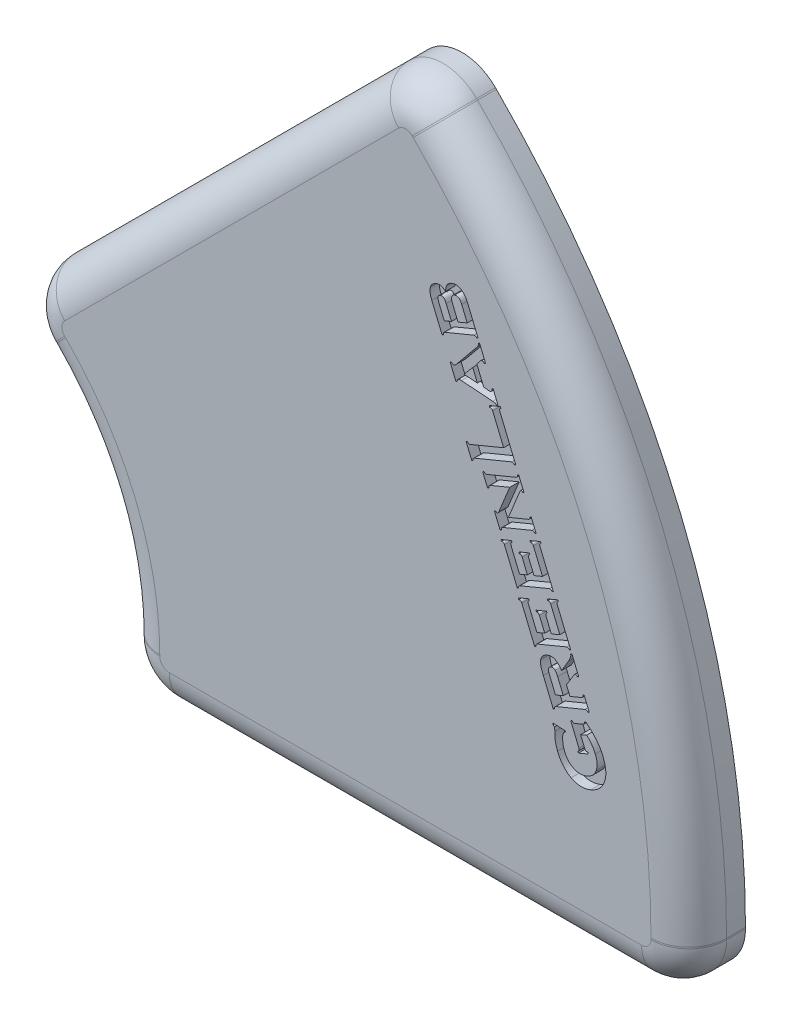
from build123d import *

# Parameters (mm, degrees)
BOSS_EXTRUDE1_DEPTH = 3
FILLET1_R           = 2.500000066
FILLET2_R           = 15
FILLET3_R           = 44.999999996
FILLET4_R           = 2
CUT_EXTRUDE1_DEPTH  = 0.5


with BuildPart() as part:
    # Sketch1 → Boss-Extrude1 (new body)
    with BuildSketch(Plane.XY.offset(3)):
        Polygon((14.999999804, -14.999999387), (14.999999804, 6.212697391), (3.2969e-05, 21.21324072), (-21.213203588, 4.59e-07), (-15.00000018, -6.213202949), (-15.00000018, -14.999999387), align=None)
    extrude(amount=-BOSS_EXTRUDE1_DEPTH)

    # Fillet1
    fillet1_edges = [part.edges().sort_by_distance(p)[0] for p in [
        (-15.00000018, -14.999999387, 1.5),
        (-21.213203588, 4.59e-07, 1.5),
        (3.2969e-05, 21.21324072, 1.5),
        (14.999999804, -14.999999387, 1.5),
    ]]
    fillet(fillet1_edges, radius=FILLET1_R)

    # Fillet2
    fillet2_edges = [part.edges().sort_by_distance(p)[0] for p in [
        (-15.00000018, -6.213202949, 1.5),
    ]]
    fillet(fillet2_edges, radius=FILLET2_R)

    # Fillet3
    fillet3_edges = [part.edges().sort_by_distance(p)[0] for p in [
        (14.999999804, 6.212697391, 1.5),
    ]]
    fillet(fillet3_edges, radius=FILLET3_R)

    # Fillet4
    fillet4_edges = [part.edges().sort_by_distance(p)[0] for p in [
        (-1.88e-07, -14.999999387, 3),
        (14.999999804, -12.463202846, 3),
        (-10.606602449, 10.60660345, 3),
        (-19.419417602, -1.793785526, 3),
        (2.3064e-05, 20.177672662, 3),
        (-20.177669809, 5.04e-07, 3),
        (14.267766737, -14.26776632, 3),
        (-14.267767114, -14.26776632, 3),
        (-15.00000018, -12.463202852, 3),
        (-16.141807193, -6.686154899, 3),
        (1.794108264, 19.419096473, 3),
        (11.574744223, 4.793948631, 3),
    ]]
    fillet(fillet4_edges, radius=FILLET4_R)

    # Sketch2 → Cut-Extrude1 (cut)
    # profile 1 of 8: a face of its own
    with BuildSketch(Plane.XY.offset(3)):
        with BuildLine():
            add(Edge.make_bspline(
                [(2.127941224, 11.787836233), (2.129226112, 11.814088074), (2.131660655, 11.863828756), (2.140308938, 11.93360717), (2.15198647, 11.994512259), (2.164456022, 12.03081588), (2.170258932, 12.047710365)],
                knots=[0, 0, 0, 0, 1.192530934, 2.259548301, 3.190052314, 4, 4, 4, 4], degree=3))
            add(Edge.make_bspline(
                [(2.170258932, 12.047710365), (2.176317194, 12.062478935), (2.188337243, 12.091780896), (2.211092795, 12.133458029), (2.239275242, 12.171326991), (2.270663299, 12.207189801), (2.30733215, 12.238901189), (2.347801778, 12.268138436), (2.393000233, 12.293416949), (2.425134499, 12.307828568), (2.441526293, 12.315179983)],
                knots=[0, 0, 0, 0, 0.975288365, 1.935045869, 2.892318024, 3.855189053, 4.841934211, 5.847990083, 6.902252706, 8, 8, 8, 8], degree=3))
            add(Edge.make_bspline(
                [(2.441526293, 12.315179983), (2.464160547, 12.323769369), (2.508417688, 12.340564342), (2.575860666, 12.357596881), (2.642367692, 12.365844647), (2.707463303, 12.366041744), (2.771354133, 12.357502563), (2.83404862, 12.342019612), (2.895465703, 12.317292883), (2.934034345, 12.295044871), (2.953679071, 12.283712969)],
                knots=[0, 0, 0, 0, 1.086541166, 2.124532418, 3.114690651, 4.089206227, 5.039081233, 6.00222883, 6.982446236, 8, 8, 8, 8], degree=3))
            add(Edge.make_bspline(
                [(2.953679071, 12.283712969), (2.97091898, 12.272288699), (3.005928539, 12.24908912), (3.054751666, 12.207496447), (3.100894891, 12.159680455), (3.145800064, 12.106781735), (3.186578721, 12.046310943), (3.226414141, 11.980867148), (3.263270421, 11.908932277), (3.285267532, 11.858312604), (3.296561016, 11.83232408)],
                knots=[0, 0, 0, 0, 0.861174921, 1.748811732, 2.665340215, 3.628214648, 4.635699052, 5.700558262, 6.819449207, 8, 8, 8, 8], degree=3))
            Line((3.296561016, 11.83232408), (3.848861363, 10.498231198))
            Line((3.848861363, 10.498231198), (3.779416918, 10.469476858))
            add(Edge.make_bspline(
                [(3.779416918, 10.469476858), (3.773317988, 10.477287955), (3.761771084, 10.492076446), (3.741915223, 10.509728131), (3.723162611, 10.524065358), (3.703200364, 10.532591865), (3.68265515, 10.536312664), (3.660771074, 10.536292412), (3.637269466, 10.531786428), (3.621637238, 10.525799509), (3.613401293, 10.522645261)],
                knots=[0, 0, 0, 0, 1.236581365, 2.34117855, 3.314027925, 4.175306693, 5.027028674, 5.909141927, 6.898417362, 8, 8, 8, 8], degree=3))
            Line((3.613401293, 10.522645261), (2.088878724, 9.891134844))
            add(Edge.make_bspline(
                [(2.088878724, 9.891134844), (2.080776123, 9.887608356), (2.065620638, 9.881012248), (2.046178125, 9.867541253), (2.03059275, 9.85297938), (2.019089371, 9.835965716), (2.012149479, 9.815984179), (2.007743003, 9.792783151), (2.007186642, 9.765607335), (2.008098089, 9.746270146), (2.008583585, 9.735969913)],
                knots=[0, 0, 0, 0, 1.103941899, 2.064864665, 2.945611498, 3.762012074, 4.607413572, 5.575512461, 6.708561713, 8, 8, 8, 8], degree=3))
            Line((2.008583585, 9.735969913), (1.939139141, 9.707215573))
            Line((1.939139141, 9.707215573), (1.398232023, 11.013096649))
            add(Edge.make_bspline(
                [(1.398232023, 11.013096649), (1.386969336, 11.040798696), (1.365189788, 11.094368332), (1.340258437, 11.174622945), (1.319357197, 11.250213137), (1.306669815, 11.322159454), (1.298718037, 11.389793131), (1.299355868, 11.453353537), (1.303591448, 11.513278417), (1.313228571, 11.550842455), (1.317936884, 11.56919474)],
                knots=[0, 0, 0, 0, 1.254135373, 2.425220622, 3.524035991, 4.542093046, 5.48818038, 6.375993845, 7.206575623, 8, 8, 8, 8], degree=3))
            add(Edge.make_bspline(
                [(1.317936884, 11.56919474), (1.323886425, 11.587421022), (1.335613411, 11.623346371), (1.359667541, 11.674372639), (1.38965437, 11.721016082), (1.424761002, 11.76382879), (1.465060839, 11.802630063), (1.511135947, 11.836639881), (1.561960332, 11.867672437), (1.598939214, 11.884097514), (1.617958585, 11.892545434)],
                knots=[0, 0, 0, 0, 1.005573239, 1.982059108, 2.950950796, 3.908573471, 4.881917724, 5.878492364, 6.908843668, 8, 8, 8, 8], degree=3))
            add(Edge.make_bspline(
                [(1.617958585, 11.892545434), (1.640364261, 11.901135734), (1.683329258, 11.917608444), (1.748614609, 11.93132209), (1.810713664, 11.93510146), (1.870934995, 11.92770071), (1.931348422, 11.90924762), (1.994470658, 11.88009148), (2.060760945, 11.838514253), (2.104690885, 11.805375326), (2.127941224, 11.787836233)],
                knots=[0, 0, 0, 0, 1.039907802, 1.994121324, 2.882115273, 3.727950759, 4.611878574, 5.612678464, 6.73648734, 8, 8, 8, 8], degree=3))
        make_face()
        with BuildLine():
            Line((2.438271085, 10.564420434), (2.157238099, 11.243131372))
            add(Edge.make_bspline(
                [(2.157238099, 11.243131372), (2.146429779, 11.26773325), (2.126497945, 11.313102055), (2.093241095, 11.373178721), (2.058552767, 11.419167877), (2.022636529, 11.45258742), (1.983134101, 11.473282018), (1.939296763, 11.479941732), (1.891549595, 11.475390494), (1.86026144, 11.463659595), (1.84365303, 11.457432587)],
                knots=[0, 0, 0, 0, 1.475550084, 2.721090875, 3.762119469, 4.627395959, 5.395873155, 6.171506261, 7.029397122, 8, 8, 8, 8], degree=3))
            add(Edge.make_bspline(
                [(1.84365303, 11.457432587), (1.827913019, 11.450121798), (1.798149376, 11.436297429), (1.761293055, 11.406659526), (1.735441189, 11.371129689), (1.721309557, 11.329220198), (1.719659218, 11.280278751), (1.728056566, 11.223240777), (1.747360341, 11.156937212), (1.76548571, 11.110423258), (1.775293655, 11.085253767)],
                knots=[0, 0, 0, 0, 0.953971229, 1.803916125, 2.575569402, 3.344643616, 4.203251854, 5.249168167, 6.511478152, 8, 8, 8, 8], degree=3))
            Line((1.775293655, 11.085253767), (2.056326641, 10.40654283))
            Line((2.056326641, 10.40654283), (2.438271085, 10.564420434))
        make_face(mode=Mode.SUBTRACT)
        with BuildLine():
            Line((3.271604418, 10.910015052), (2.980805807, 11.611512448))
            add(Edge.make_bspline(
                [(2.980805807, 11.611512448), (2.969059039, 11.637819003), (2.947014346, 11.687187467), (2.907714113, 11.752873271), (2.863987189, 11.80414997), (2.817356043, 11.842921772), (2.76600546, 11.866440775), (2.711519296, 11.8758831), (2.653784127, 11.871427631), (2.616701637, 11.857881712), (2.597233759, 11.850770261)],
                knots=[0, 0, 0, 0, 1.344598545, 2.523354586, 3.559144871, 4.478236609, 5.332149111, 6.163643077, 7.035933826, 8, 8, 8, 8], degree=3))
            add(Edge.make_bspline(
                [(2.597233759, 11.850770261), (2.578474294, 11.842014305), (2.542678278, 11.825306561), (2.498446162, 11.787822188), (2.466272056, 11.742757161), (2.447745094, 11.689425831), (2.440874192, 11.62928374), (2.447639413, 11.56208671), (2.464518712, 11.487550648), (2.484198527, 11.437125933), (2.494694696, 11.410232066)],
                knots=[0, 0, 0, 0, 0.962800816, 1.837175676, 2.673225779, 3.516995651, 4.443593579, 5.476858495, 6.65429024, 8, 8, 8, 8], degree=3))
            Line((2.494694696, 11.410232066), (2.785493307, 10.70873467))
            Line((2.785493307, 10.70873467), (3.271604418, 10.910015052))
        make_face(mode=Mode.SUBTRACT)
    # profile 2 of 8: a face of its own
    with BuildSketch(Plane.XY.offset(3)):
        with BuildLine():
            Line((3.783149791, 9.282073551), (4.146648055, 8.404794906))
            Line((4.146648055, 8.404794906), (4.39187375, 8.383093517))
            add(Edge.make_bspline(
                [(4.39187375, 8.383093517), (4.405617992, 8.382281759), (4.431120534, 8.380775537), (4.466487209, 8.38254303), (4.496181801, 8.386149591), (4.513278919, 8.391893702), (4.520997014, 8.394486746)],
                knots=[0, 0, 0, 0, 1.264282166, 2.345884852, 3.253288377, 4, 4, 4, 4], degree=3))
            add(Edge.make_bspline(
                [(4.520997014, 8.394486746), (4.527059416, 8.39756254), (4.538864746, 8.403552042), (4.554725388, 8.415422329), (4.566228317, 8.431502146), (4.574992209, 8.449812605), (4.57977237, 8.471106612), (4.581035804, 8.494834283), (4.580244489, 8.521472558), (4.576619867, 8.539920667), (4.574707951, 8.549651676)],
                knots=[0, 0, 0, 0, 0.906553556, 1.765333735, 2.609426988, 3.515659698, 4.457456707, 5.497006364, 6.679720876, 8, 8, 8, 8], degree=3))
            Line((4.574707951, 8.549651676), (4.644152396, 8.578406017))
            Line((4.644152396, 8.578406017), (4.917589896, 7.918683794))
            Line((4.917589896, 7.918683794), (4.848145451, 7.889929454))
            add(Edge.make_bspline(
                [(4.848145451, 7.889929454), (4.842185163, 7.899281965), (4.830908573, 7.916976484), (4.811998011, 7.940159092), (4.791873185, 7.957917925), (4.769621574, 7.970650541), (4.743765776, 7.980087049), (4.71188357, 7.987432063), (4.672666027, 7.993111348), (4.64398613, 7.995859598), (4.628418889, 7.997351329)],
                knots=[0, 0, 0, 0, 1.030442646, 1.94954988, 2.771933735, 3.510104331, 4.318799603, 5.321862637, 6.546326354, 8, 8, 8, 8], degree=3))
            Line((4.628418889, 7.997351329), (2.963922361, 8.117251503))
            add(Edge.make_bspline(
                [(2.963922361, 8.117251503), (2.948913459, 8.117842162), (2.920507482, 8.118960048), (2.879777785, 8.117035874), (2.843337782, 8.110997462), (2.821331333, 8.103087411), (2.810927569, 8.099347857)],
                knots=[0, 0, 0, 0, 1.160238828, 2.195878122, 3.147083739, 4, 4, 4, 4], degree=3))
            add(Edge.make_bspline(
                [(2.810927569, 8.099347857), (2.800293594, 8.093812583), (2.778755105, 8.082601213), (2.758097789, 8.049449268), (2.745455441, 8.008446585), (2.744640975, 7.97776932), (2.744195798, 7.961001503)],
                knots=[0, 0, 0, 0, 0.866782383, 1.755616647, 2.773247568, 4, 4, 4, 4], degree=3))
            Line((2.744195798, 7.961001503), (2.674751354, 7.932247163))
            Line((2.674751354, 7.932247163), (2.370389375, 8.665754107))
            Line((2.370389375, 8.665754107), (2.439833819, 8.694508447))
            add(Edge.make_bspline(
                [(2.439833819, 8.694508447), (2.451946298, 8.682921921), (2.474282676, 8.661555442), (2.513783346, 8.641942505), (2.554560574, 8.635602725), (2.579569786, 8.643722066), (2.592286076, 8.647850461)],
                knots=[0, 0, 0, 0, 1.175966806, 2.168576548, 3.068786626, 4, 4, 4, 4], degree=3))
            add(Edge.make_bspline(
                [(2.592286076, 8.647850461), (2.601672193, 8.652459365), (2.621761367, 8.662323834), (2.650548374, 8.684304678), (2.680153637, 8.712495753), (2.699000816, 8.734470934), (2.708931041, 8.746049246)],
                knots=[0, 0, 0, 0, 0.814224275, 1.742690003, 2.810665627, 4, 4, 4, 4], degree=3))
            Line((2.708931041, 8.746049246), (3.749512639, 10.012867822))
            add(Edge.make_bspline(
                [(3.749512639, 10.012867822), (3.762197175, 10.029116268), (3.785384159, 10.058817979), (3.81646917, 10.099453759), (3.837630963, 10.134079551), (3.853152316, 10.162600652), (3.860633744, 10.190415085), (3.862912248, 10.219517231), (3.862113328, 10.251855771), (3.857657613, 10.274052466), (3.855306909, 10.285762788)],
                knots=[0, 0, 0, 0, 1.613335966, 2.949133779, 3.997563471, 4.788566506, 5.478582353, 6.2318565, 7.067179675, 8, 8, 8, 8], degree=3))
            Line((3.855306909, 10.285762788), (3.924751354, 10.314517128))
            Line((3.924751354, 10.314517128), (4.248644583, 9.533267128))
            Line((4.248644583, 9.533267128), (4.179200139, 9.504512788))
            add(Edge.make_bspline(
                [(4.179200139, 9.504512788), (4.174151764, 9.512078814), (4.164620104, 9.526363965), (4.148028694, 9.544434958), (4.131252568, 9.559101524), (4.113241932, 9.56891817), (4.094574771, 9.574675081), (4.075205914, 9.576139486), (4.054982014, 9.574233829), (4.042041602, 9.569383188), (4.035428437, 9.566904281)],
                knots=[0, 0, 0, 0, 1.261042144, 2.380929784, 3.39690099, 4.340805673, 5.206666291, 6.088759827, 7.023265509, 8, 8, 8, 8], degree=3))
            add(Edge.make_bspline(
                [(4.035428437, 9.566904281), (4.026588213, 9.562465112), (4.007804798, 9.553032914), (3.980949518, 9.532041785), (3.953378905, 9.504708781), (3.935768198, 9.483348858), (3.926378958, 9.471960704)],
                knots=[0, 0, 0, 0, 0.811807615, 1.724901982, 2.787019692, 4, 4, 4, 4], degree=3))
            Line((3.926378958, 9.471960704), (3.783149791, 9.282073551))
        make_face()
        Polygon((3.565050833, 9.022741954), (3.100641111, 8.473154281), (3.811361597, 8.428123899), align=None, mode=Mode.SUBTRACT)
    # profile 3 of 8: a face of its own
    with BuildSketch(Plane.XY.offset(3)):
        with BuildLine():
            Line((5.200452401, 6.155581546), (4.61777011, 7.561289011))
            add(Edge.make_bspline(
                [(4.61777011, 7.561289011), (4.614244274, 7.569393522), (4.607649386, 7.584552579), (4.594170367, 7.603971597), (4.579635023, 7.61963466), (4.562474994, 7.630905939), (4.542818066, 7.638910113), (4.519503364, 7.642053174), (4.492593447, 7.643323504), (4.473449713, 7.641487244), (4.463147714, 7.640499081)],
                knots=[0, 0, 0, 0, 1.106164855, 2.069022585, 2.951542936, 3.769587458, 4.624855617, 5.590915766, 6.703576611, 8, 8, 8, 8], degree=3))
            Line((4.463147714, 7.640499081), (4.434393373, 7.709943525))
            Line((4.434393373, 7.709943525), (5.024671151, 7.954626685))
            Line((5.024671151, 7.954626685), (5.053425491, 7.88518224))
            add(Edge.make_bspline(
                [(5.053425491, 7.88518224), (5.045481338, 7.87867747), (5.03050022, 7.866410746), (5.012076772, 7.846498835), (4.998487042, 7.826980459), (4.989298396, 7.80781469), (4.985314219, 7.787517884), (4.986147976, 7.765933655), (4.991236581, 7.742564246), (4.997148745, 7.726873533), (5.000257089, 7.718624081)],
                knots=[0, 0, 0, 0, 1.277501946, 2.409118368, 3.364826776, 4.231481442, 5.035291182, 5.913860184, 6.903203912, 8, 8, 8, 8], degree=3))
            Line((5.000257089, 7.718624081), (5.841185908, 5.689001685))
            Line((5.841185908, 5.689001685), (5.771741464, 5.660247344))
            add(Edge.make_bspline(
                [(5.771741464, 5.660247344), (5.765238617, 5.668195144), (5.752975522, 5.683183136), (5.733040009, 5.701561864), (5.713789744, 5.715149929), (5.694647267, 5.723858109), (5.674633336, 5.727658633), (5.653027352, 5.72774468), (5.629667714, 5.722371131), (5.613975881, 5.71650165), (5.605725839, 5.713415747)],
                knots=[0, 0, 0, 0, 1.282320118, 2.418204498, 3.377517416, 4.217558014, 5.024399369, 5.905992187, 6.899067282, 8, 8, 8, 8], degree=3))
            Line((5.605725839, 5.713415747), (3.663451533, 4.908836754))
            add(Edge.make_bspline(
                [(3.663451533, 4.908836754), (3.655340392, 4.905321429), (3.639937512, 4.898645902), (3.62042885, 4.884826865), (3.604603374, 4.870151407), (3.593164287, 4.853115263), (3.586013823, 4.833203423), (3.582624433, 4.810051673), (3.581436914, 4.783109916), (3.583260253, 4.76397115), (3.584241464, 4.753671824)],
                knots=[0, 0, 0, 0, 1.102939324, 2.094457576, 2.974404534, 3.790063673, 4.634697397, 5.597940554, 6.707356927, 8, 8, 8, 8], degree=3))
            Line((3.584241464, 4.753671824), (3.514797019, 4.724917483))
            Line((3.514797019, 4.724917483), (3.212605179, 5.45408415))
            Line((3.212605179, 5.45408415), (3.282049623, 5.48283849))
            add(Edge.make_bspline(
                [(3.282049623, 5.48283849), (3.288365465, 5.474886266), (3.300258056, 5.459912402), (3.319907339, 5.441472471), (3.338874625, 5.427228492), (3.35857887, 5.418576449), (3.379227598, 5.415460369), (3.401116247, 5.415995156), (3.424822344, 5.421291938), (3.440717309, 5.427120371), (3.449150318, 5.430212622)],
                knots=[0, 0, 0, 0, 1.257483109, 2.367813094, 3.332258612, 4.186097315, 5.004456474, 5.901652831, 6.886730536, 8, 8, 8, 8], degree=3))
            Line((3.449150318, 5.430212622), (5.200452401, 6.155581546))
        make_face()
    # profile 4 of 8: a face of its own
    with BuildSketch(Plane.XY.offset(3)):
        with BuildLine():
            Line((5.451829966, 3.090660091), (6.508687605, 3.528485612))
            add(Edge.make_bspline(
                [(6.508687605, 3.528485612), (6.516797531, 3.532001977), (6.532198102, 3.538679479), (6.55172216, 3.552485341), (6.567682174, 3.567375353), (6.579505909, 3.584724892), (6.587151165, 3.604996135), (6.591165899, 3.628312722), (6.593038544, 3.655106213), (6.591101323, 3.674073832), (6.590067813, 3.684193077)],
                knots=[0, 0, 0, 0, 1.097023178, 2.083222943, 2.958449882, 3.800960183, 4.670091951, 5.632123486, 6.736735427, 8, 8, 8, 8], degree=3))
            Line((6.590067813, 3.684193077), (6.659512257, 3.712947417))
            Line((6.659512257, 3.712947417), (6.91830132, 3.087947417))
            Line((6.91830132, 3.087947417), (6.848856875, 3.059193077))
            add(Edge.make_bspline(
                [(6.848856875, 3.059193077), (6.842757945, 3.067004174), (6.831211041, 3.081792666), (6.81135518, 3.09944435), (6.792602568, 3.113781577), (6.772640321, 3.122308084), (6.752095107, 3.126028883), (6.730211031, 3.126008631), (6.706709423, 3.121502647), (6.691077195, 3.115515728), (6.68284125, 3.11236148)],
                knots=[0, 0, 0, 0, 1.236581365, 2.34117855, 3.314027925, 4.175306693, 5.027028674, 5.909141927, 6.898417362, 8, 8, 8, 8], degree=3))
            Line((6.68284125, 3.11236148), (5.158318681, 2.480851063))
            add(Edge.make_bspline(
                [(5.158318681, 2.480851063), (5.15021608, 2.477324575), (5.135060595, 2.470728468), (5.115618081, 2.457257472), (5.100032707, 2.442695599), (5.088529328, 2.425681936), (5.081589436, 2.405700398), (5.077182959, 2.382499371), (5.076626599, 2.355323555), (5.077538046, 2.335986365), (5.078023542, 2.325686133)],
                knots=[0, 0, 0, 0, 1.103941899, 2.064864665, 2.945611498, 3.762012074, 4.607413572, 5.575512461, 6.708561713, 8, 8, 8, 8], degree=3))
            Line((5.078023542, 2.325686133), (5.008579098, 2.296931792))
            Line((5.008579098, 2.296931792), (4.709099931, 3.020673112))
            Line((4.709099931, 3.020673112), (4.778544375, 3.049427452))
            add(Edge.make_bspline(
                [(4.778544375, 3.049427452), (4.786303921, 3.039832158), (4.800270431, 3.022561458), (4.824349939, 3.003929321), (4.850056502, 2.995442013), (4.86573098, 2.999980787), (4.873487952, 3.002226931)],
                knots=[0, 0, 0, 0, 1.290592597, 2.322955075, 3.170065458, 4, 4, 4, 4], degree=3))
            add(Edge.make_bspline(
                [(4.873487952, 3.002226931), (4.880252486, 3.005867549), (4.894956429, 3.013781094), (4.913077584, 3.034517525), (4.929972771, 3.061788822), (4.939407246, 3.082917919), (4.94456, 3.094457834)],
                knots=[0, 0, 0, 0, 0.768948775, 1.671449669, 2.72823375, 4, 4, 4, 4], degree=3))
            Line((4.94456, 3.094457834), (5.523444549, 4.503420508))
            Line((5.523444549, 4.503420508), (4.49642632, 4.078073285))
            add(Edge.make_bspline(
                [(4.49642632, 4.078073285), (4.488276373, 4.074607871), (4.472936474, 4.068085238), (4.453906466, 4.053689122), (4.437512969, 4.039617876), (4.426293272, 4.022205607), (4.418254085, 4.002587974), (4.415099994, 3.97908107), (4.413840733, 3.952172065), (4.415693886, 3.933029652), (4.416673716, 3.922908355)],
                knots=[0, 0, 0, 0, 1.102098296, 2.07437886, 2.970064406, 3.785101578, 4.637225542, 5.599734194, 6.730891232, 8, 8, 8, 8], degree=3))
            Line((4.416673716, 3.922908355), (4.347229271, 3.894154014))
            Line((4.347229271, 3.894154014), (4.087897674, 4.519154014))
            Line((4.087897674, 4.519154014), (4.157342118, 4.547908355))
            add(Edge.make_bspline(
                [(4.157342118, 4.547908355), (4.164082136, 4.540013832), (4.176638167, 4.525307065), (4.196281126, 4.506305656), (4.215610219, 4.492559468), (4.235136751, 4.483701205), (4.255369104, 4.479835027), (4.276963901, 4.48057), (4.300119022, 4.485819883), (4.315648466, 4.491644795), (4.323900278, 4.494739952)],
                knots=[0, 0, 0, 0, 1.292312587, 2.40745913, 3.394500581, 4.231390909, 5.05730115, 5.935876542, 6.903195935, 8, 8, 8, 8], degree=3))
            Line((4.323900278, 4.494739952), (5.846795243, 5.125707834))
            add(Edge.make_bspline(
                [(5.846795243, 5.125707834), (5.854874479, 5.129271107), (5.870123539, 5.135996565), (5.889962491, 5.149129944), (5.90566365, 5.163862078), (5.916985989, 5.180992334), (5.924919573, 5.200881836), (5.928702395, 5.22447405), (5.930494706, 5.251760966), (5.928981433, 5.27110991), (5.928175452, 5.281415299)],
                knots=[0, 0, 0, 0, 1.096910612, 2.070351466, 2.945488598, 3.75668931, 4.604802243, 5.588845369, 6.715801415, 8, 8, 8, 8], degree=3))
            Line((5.928175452, 5.281415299), (5.997619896, 5.310169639))
            Line((5.997619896, 5.310169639), (6.277567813, 4.63471391))
            Line((6.277567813, 4.63471391), (6.208123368, 4.60595957))
            add(Edge.make_bspline(
                [(6.208123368, 4.60595957), (6.200950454, 4.615898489), (6.188111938, 4.633687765), (6.164978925, 4.653379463), (6.139523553, 4.66137323), (6.124008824, 4.657312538), (6.116435, 4.65533023)],
                knots=[0, 0, 0, 0, 1.298838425, 2.324739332, 3.182188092, 4, 4, 4, 4], degree=3))
            add(Edge.make_bspline(
                [(6.116435, 4.65533023), (6.108741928, 4.650759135), (6.092000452, 4.64081163), (6.077914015, 4.617447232), (6.065548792, 4.592279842), (6.052751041, 4.563534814), (6.036365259, 4.525986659), (6.024694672, 4.497838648), (6.018236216, 4.482261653)],
                knots=[0, 0, 0, 0, 0.785082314, 1.70847705, 2.355648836, 3.291143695, 4.50092995, 6, 6, 6, 6], degree=3))
            Line((6.018236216, 4.482261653), (5.451829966, 3.090660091))
        make_face()
    # profile 5 of 8: a face of its own
    with BuildSketch(Plane.XY.offset(3)):
        with BuildLine():
            Line((6.806501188, 1.099095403), (7.257890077, 1.286269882))
            Line((7.257890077, 1.286269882), (6.775576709, 2.450006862))
            add(Edge.make_bspline(
                [(6.775576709, 2.450006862), (6.771961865, 2.45787165), (6.765183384, 2.472619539), (6.752770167, 2.492312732), (6.737758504, 2.50723545), (6.720856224, 2.518565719), (6.701156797, 2.526539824), (6.677857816, 2.529662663), (6.650917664, 2.531077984), (6.631794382, 2.528810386), (6.621496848, 2.527589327)],
                knots=[0, 0, 0, 0, 1.092215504, 2.048099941, 2.919603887, 3.742532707, 4.602907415, 5.574735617, 6.694039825, 8, 8, 8, 8], degree=3))
            Line((6.621496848, 2.527589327), (6.592742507, 2.597033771))
            Line((6.592742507, 2.597033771), (7.148298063, 2.827611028))
            Line((7.148298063, 2.827611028), (7.177052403, 2.758166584))
            add(Edge.make_bspline(
                [(7.177052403, 2.758166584), (7.169304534, 2.752015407), (7.154539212, 2.740292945), (7.13609624, 2.721060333), (7.122692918, 2.701577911), (7.113316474, 2.682273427), (7.109663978, 2.661573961), (7.109628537, 2.63987645), (7.114289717, 2.616398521), (7.120196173, 2.600930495), (7.123341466, 2.592693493)],
                knots=[0, 0, 0, 0, 1.238164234, 2.35960291, 3.320710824, 4.192261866, 5.022832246, 5.928721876, 6.897007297, 8, 8, 8, 8], degree=3))
            Line((7.123341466, 2.592693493), (7.835147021, 0.874486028))
            Line((7.835147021, 0.874486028), (7.765702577, 0.845731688))
            add(Edge.make_bspline(
                [(7.765702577, 0.845731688), (7.759603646, 0.853542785), (7.748056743, 0.868331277), (7.728200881, 0.885982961), (7.70944827, 0.900320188), (7.689486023, 0.908846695), (7.668940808, 0.912567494), (7.647056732, 0.912547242), (7.623555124, 0.908041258), (7.607922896, 0.902054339), (7.599686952, 0.898900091)],
                knots=[0, 0, 0, 0, 1.236581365, 2.34117855, 3.314027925, 4.175306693, 5.027028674, 5.909141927, 6.898417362, 8, 8, 8, 8], degree=3))
            Line((7.599686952, 0.898900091), (6.075164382, 0.267389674))
            add(Edge.make_bspline(
                [(6.075164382, 0.267389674), (6.067061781, 0.263863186), (6.051906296, 0.257267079), (6.032463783, 0.243796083), (6.016878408, 0.22923421), (6.005375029, 0.212220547), (5.998435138, 0.192239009), (5.994028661, 0.169037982), (5.9934723, 0.141862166), (5.994383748, 0.122524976), (5.994869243, 0.112224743)],
                knots=[0, 0, 0, 0, 1.103941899, 2.064864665, 2.945611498, 3.762012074, 4.607413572, 5.575512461, 6.708561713, 8, 8, 8, 8], degree=3))
            Line((5.994869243, 0.112224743), (5.925424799, 0.083470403))
            Line((5.925424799, 0.083470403), (5.242373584, 1.732233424))
            add(Edge.make_bspline(
                [(5.242373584, 1.732233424), (5.238858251, 1.740344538), (5.23218271, 1.755747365), (5.218363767, 1.775256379), (5.203688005, 1.791080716), (5.186652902, 1.8025237), (5.166906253, 1.809597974), (5.14378302, 1.813112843), (5.116979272, 1.814369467), (5.097864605, 1.812101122), (5.087751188, 1.810900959)],
                knots=[0, 0, 0, 0, 1.105766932, 2.099827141, 2.982030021, 3.799780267, 4.64657938, 5.589927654, 6.724850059, 8, 8, 8, 8], degree=3))
            Line((5.087751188, 1.810900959), (5.058996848, 1.880345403))
            Line((5.058996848, 1.880345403), (5.614552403, 2.110380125))
            Line((5.614552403, 2.110380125), (5.643306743, 2.040935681))
            add(Edge.make_bspline(
                [(5.643306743, 2.040935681), (5.635159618, 2.034448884), (5.619995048, 2.022374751), (5.601602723, 2.002575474), (5.58710496, 1.984152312), (5.57871343, 1.964898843), (5.574612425, 1.945090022), (5.575638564, 1.923911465), (5.579932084, 1.900797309), (5.58588385, 1.885327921), (5.589053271, 1.877090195)],
                knots=[0, 0, 0, 0, 1.308299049, 2.435189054, 3.395591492, 4.241295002, 5.053575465, 5.918653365, 6.891645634, 8, 8, 8, 8], degree=3))
            Line((5.589053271, 1.877090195), (6.042612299, 0.78279766))
            Line((6.042612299, 0.78279766), (6.459278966, 0.955323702))
            Line((6.459278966, 0.955323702), (6.17824598, 1.633492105))
            add(Edge.make_bspline(
                [(6.17824598, 1.633492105), (6.174887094, 1.641228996), (6.168463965, 1.656024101), (6.155311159, 1.674848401), (6.141145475, 1.690400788), (6.123967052, 1.700961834), (6.10426939, 1.708255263), (6.080897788, 1.71164544), (6.053805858, 1.712673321), (6.034469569, 1.711276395), (6.024166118, 1.710532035)],
                knots=[0, 0, 0, 0, 1.066378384, 2.039214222, 2.898466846, 3.712496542, 4.568378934, 5.544450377, 6.691546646, 8, 8, 8, 8], degree=3))
            Line((6.024166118, 1.710532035), (5.995411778, 1.77997648))
            Line((5.995411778, 1.77997648), (6.550967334, 2.010553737))
            Line((6.550967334, 2.010553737), (6.579721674, 1.941109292))
            add(Edge.make_bspline(
                [(6.579721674, 1.941109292), (6.571997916, 1.934558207), (6.557636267, 1.922377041), (6.539219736, 1.903106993), (6.525384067, 1.884255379), (6.516252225, 1.865155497), (6.51138006, 1.845313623), (6.512803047, 1.824140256), (6.516132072, 1.800904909), (6.522220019, 1.78548891), (6.525468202, 1.777263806)],
                knots=[0, 0, 0, 0, 1.279885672, 2.379834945, 3.363340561, 4.222568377, 5.043519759, 5.912730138, 6.886351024, 8, 8, 8, 8], degree=3))
            Line((6.525468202, 1.777263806), (6.806501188, 1.099095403))
        make_face()
    # profile 6 of 8: a face of its own
    with BuildSketch(Plane.XY.offset(3)):
        with BuildLine():
            Line((7.723346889, -1.114365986), (8.174735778, -0.927191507))
            Line((8.174735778, -0.927191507), (7.69242241, 0.236545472))
            add(Edge.make_bspline(
                [(7.69242241, 0.236545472), (7.688807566, 0.244410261), (7.682029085, 0.25915815), (7.669615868, 0.278851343), (7.654604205, 0.293774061), (7.637701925, 0.30510433), (7.618002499, 0.313078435), (7.594703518, 0.316201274), (7.567763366, 0.317616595), (7.548640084, 0.315348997), (7.538342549, 0.314127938)],
                knots=[0, 0, 0, 0, 1.092215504, 2.048099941, 2.919603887, 3.742532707, 4.602907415, 5.574735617, 6.694039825, 8, 8, 8, 8], degree=3))
            Line((7.538342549, 0.314127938), (7.509588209, 0.383572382))
            Line((7.509588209, 0.383572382), (8.065143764, 0.614149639))
            Line((8.065143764, 0.614149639), (8.093898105, 0.544705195))
            add(Edge.make_bspline(
                [(8.093898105, 0.544705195), (8.086150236, 0.538554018), (8.071384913, 0.526831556), (8.052941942, 0.507598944), (8.03953862, 0.488116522), (8.030162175, 0.468812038), (8.026509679, 0.448112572), (8.026474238, 0.426415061), (8.031135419, 0.402937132), (8.037041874, 0.387469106), (8.040187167, 0.379232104)],
                knots=[0, 0, 0, 0, 1.238164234, 2.35960291, 3.320710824, 4.192261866, 5.022832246, 5.928721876, 6.897007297, 8, 8, 8, 8], degree=3))
            Line((8.040187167, 0.379232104), (8.751992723, -1.338975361))
            Line((8.751992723, -1.338975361), (8.682548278, -1.367729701))
            add(Edge.make_bspline(
                [(8.682548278, -1.367729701), (8.676449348, -1.359918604), (8.664902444, -1.345130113), (8.645046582, -1.327478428), (8.626293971, -1.313141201), (8.606331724, -1.304614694), (8.58578651, -1.300893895), (8.563902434, -1.300914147), (8.540400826, -1.305420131), (8.524768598, -1.31140705), (8.516532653, -1.314561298)],
                knots=[0, 0, 0, 0, 1.236581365, 2.34117855, 3.314027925, 4.175306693, 5.027028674, 5.909141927, 6.898417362, 8, 8, 8, 8], degree=3))
            Line((8.516532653, -1.314561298), (6.992010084, -1.946071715))
            add(Edge.make_bspline(
                [(6.992010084, -1.946071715), (6.983907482, -1.949598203), (6.968751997, -1.956194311), (6.949309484, -1.969665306), (6.93372411, -1.984227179), (6.922220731, -2.001240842), (6.915280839, -2.02122238), (6.910874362, -2.044423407), (6.910318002, -2.071599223), (6.911229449, -2.090936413), (6.911714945, -2.101236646)],
                knots=[0, 0, 0, 0, 1.103941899, 2.064864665, 2.945611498, 3.762012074, 4.607413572, 5.575512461, 6.708561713, 8, 8, 8, 8], degree=3))
            Line((6.911714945, -2.101236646), (6.8422705, -2.129990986))
            Line((6.8422705, -2.129990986), (6.159219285, -0.481227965))
            add(Edge.make_bspline(
                [(6.159219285, -0.481227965), (6.155703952, -0.473116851), (6.149028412, -0.457714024), (6.135209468, -0.43820501), (6.120533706, -0.422380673), (6.103498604, -0.410937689), (6.083751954, -0.403863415), (6.060628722, -0.400348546), (6.033824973, -0.399091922), (6.014710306, -0.401360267), (6.004596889, -0.40256043)],
                knots=[0, 0, 0, 0, 1.105766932, 2.099827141, 2.982030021, 3.799780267, 4.64657938, 5.589927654, 6.724850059, 8, 8, 8, 8], degree=3))
            Line((6.004596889, -0.40256043), (5.975842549, -0.333115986))
            Line((5.975842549, -0.333115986), (6.531398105, -0.103081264))
            Line((6.531398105, -0.103081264), (6.560152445, -0.172525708))
            add(Edge.make_bspline(
                [(6.560152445, -0.172525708), (6.552005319, -0.179012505), (6.53684075, -0.191086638), (6.518448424, -0.210885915), (6.503950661, -0.229309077), (6.495559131, -0.248562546), (6.491458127, -0.268371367), (6.492484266, -0.289549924), (6.496777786, -0.31266408), (6.502729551, -0.328133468), (6.505898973, -0.336371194)],
                knots=[0, 0, 0, 0, 1.308299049, 2.435189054, 3.395591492, 4.241295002, 5.053575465, 5.918653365, 6.891645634, 8, 8, 8, 8], degree=3))
            Line((6.505898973, -0.336371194), (6.959458, -1.430663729))
            Line((6.959458, -1.430663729), (7.376124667, -1.258137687))
            Line((7.376124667, -1.258137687), (7.095091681, -0.579969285))
            add(Edge.make_bspline(
                [(7.095091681, -0.579969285), (7.091732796, -0.572232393), (7.085309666, -0.557437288), (7.07215686, -0.538612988), (7.057991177, -0.523060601), (7.040812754, -0.512499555), (7.021115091, -0.505206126), (6.997743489, -0.501815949), (6.97065156, -0.500788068), (6.95131527, -0.502184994), (6.94101182, -0.502929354)],
                knots=[0, 0, 0, 0, 1.066378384, 2.039214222, 2.898466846, 3.712496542, 4.568378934, 5.544450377, 6.691546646, 8, 8, 8, 8], degree=3))
            Line((6.94101182, -0.502929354), (6.91225748, -0.43348491))
            Line((6.91225748, -0.43348491), (7.467813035, -0.202907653))
            Line((7.467813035, -0.202907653), (7.496567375, -0.272352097))
            add(Edge.make_bspline(
                [(7.496567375, -0.272352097), (7.488843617, -0.278903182), (7.474481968, -0.291084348), (7.456065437, -0.310354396), (7.442229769, -0.32920601), (7.433097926, -0.348305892), (7.428225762, -0.368147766), (7.429648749, -0.389321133), (7.432977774, -0.41255648), (7.43906572, -0.427972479), (7.442313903, -0.436197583)],
                knots=[0, 0, 0, 0, 1.279885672, 2.379834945, 3.363340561, 4.222568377, 5.043519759, 5.912730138, 6.886351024, 8, 8, 8, 8], degree=3))
            Line((7.442313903, -0.436197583), (7.723346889, -1.114365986))
        make_face()
    # profile 7 of 8: a face of its own
    with BuildSketch(Plane.XY.offset(3)):
        with BuildLine():
            Line((8.706630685, -3.488223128), (9.309386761, -3.238657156))
            add(Edge.make_bspline(
                [(9.309386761, -3.238657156), (9.317469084, -3.235102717), (9.332954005, -3.228292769), (9.352935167, -3.214852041), (9.368704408, -3.199790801), (9.380946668, -3.182902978), (9.388277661, -3.162436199), (9.393210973, -3.13890398), (9.394506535, -3.111512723), (9.393482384, -3.092165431), (9.392937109, -3.081864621)],
                knots=[0, 0, 0, 0, 1.087635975, 2.083801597, 2.951539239, 3.76846645, 4.630161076, 5.61020971, 6.727637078, 8, 8, 8, 8], degree=3))
            Line((9.392937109, -3.081864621), (9.462381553, -3.053110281))
            Line((9.462381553, -3.053110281), (9.735276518, -3.712832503))
            Line((9.735276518, -3.712832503), (9.665832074, -3.741586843))
            add(Edge.make_bspline(
                [(9.665832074, -3.741586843), (9.659733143, -3.733775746), (9.64818624, -3.718987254), (9.628330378, -3.70133557), (9.609577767, -3.686998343), (9.58961552, -3.678471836), (9.569070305, -3.674751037), (9.547186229, -3.674771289), (9.523684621, -3.679277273), (9.508052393, -3.685264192), (9.499816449, -3.68841844)],
                knots=[0, 0, 0, 0, 1.236581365, 2.34117855, 3.314027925, 4.175306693, 5.027028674, 5.909141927, 6.898417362, 8, 8, 8, 8], degree=3))
            Line((9.499816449, -3.68841844), (7.975293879, -4.319928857))
            add(Edge.make_bspline(
                [(7.975293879, -4.319928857), (7.967191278, -4.323455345), (7.952035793, -4.330051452), (7.93259328, -4.343522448), (7.917007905, -4.358084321), (7.905504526, -4.375097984), (7.898564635, -4.395079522), (7.894158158, -4.418280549), (7.893601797, -4.445456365), (7.894513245, -4.464793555), (7.894998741, -4.475093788)],
                knots=[0, 0, 0, 0, 1.103941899, 2.064864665, 2.945611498, 3.762012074, 4.607413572, 5.575512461, 6.708561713, 8, 8, 8, 8], degree=3))
            Line((7.894998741, -4.475093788), (7.825554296, -4.503848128))
            Line((7.825554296, -4.503848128), (7.30092322, -3.237029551))
            add(Edge.make_bspline(
                [(7.30092322, -3.237029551), (7.292742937, -3.216972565), (7.276927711, -3.178195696), (7.254646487, -3.121603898), (7.234309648, -3.068585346), (7.21726521, -3.018424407), (7.201197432, -2.971991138), (7.188158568, -2.928734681), (7.178026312, -2.888794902), (7.166110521, -2.840863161), (7.156927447, -2.78307433), (7.151201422, -2.715237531), (7.152075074, -2.648687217), (7.157647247, -2.605302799), (7.160406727, -2.583817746)],
                knots=[0, 0, 0, 0, 1.151525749, 2.226284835, 3.233380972, 4.169854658, 5.042409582, 5.845402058, 6.570613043, 7.232869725, 8.470438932, 9.676039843, 10.849116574, 12, 12, 12, 12], degree=3))
            add(Edge.make_bspline(
                [(7.160406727, -2.583817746), (7.164912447, -2.562507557), (7.173828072, -2.520340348), (7.196833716, -2.460273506), (7.228165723, -2.404746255), (7.267717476, -2.354018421), (7.31484055, -2.307608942), (7.369716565, -2.265626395), (7.432500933, -2.227901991), (7.478446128, -2.207526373), (7.502203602, -2.196990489)],
                knots=[0, 0, 0, 0, 0.965833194, 1.911127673, 2.842201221, 3.786438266, 4.757197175, 5.770448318, 6.847136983, 8, 8, 8, 8], degree=3))
            add(Edge.make_bspline(
                [(7.502203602, -2.196990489), (7.520717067, -2.189779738), (7.556742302, -2.175748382), (7.611322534, -2.160851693), (7.664349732, -2.149799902), (7.716247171, -2.145886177), (7.766770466, -2.146090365), (7.815752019, -2.152080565), (7.86342572, -2.163605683), (7.909816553, -2.1805664), (7.955415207, -2.203212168), (8.000562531, -2.231691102), (8.04566744, -2.266105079), (8.090504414, -2.306323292), (8.135398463, -2.352255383), (8.179421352, -2.404513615), (8.22427939, -2.461905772), (8.25223697, -2.503341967), (8.266635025, -2.524681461)],
                knots=[0, 0, 0, 0, 1.034903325, 2.013811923, 2.945562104, 3.853646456, 4.720939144, 5.575640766, 6.419302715, 7.272182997, 8.144838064, 9.068109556, 10.050371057, 11.098583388, 12.20514809, 13.39528346, 14.658580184, 16, 16, 16, 16], degree=3))
            Line((8.266635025, -2.524681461), (8.621995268, -1.93060594))
            add(Edge.make_bspline(
                [(8.621995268, -1.93060594), (8.636510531, -1.905594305), (8.663491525, -1.859102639), (8.69748018, -1.793098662), (8.723701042, -1.737315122), (8.741200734, -1.68925487), (8.750889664, -1.645641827), (8.754694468, -1.603542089), (8.753273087, -1.561174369), (8.747881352, -1.533420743), (8.74515065, -1.519364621)],
                knots=[0, 0, 0, 0, 1.5735391, 2.924896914, 4.03916645, 4.926305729, 5.702383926, 6.463337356, 7.221740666, 8, 8, 8, 8], degree=3))
            Line((8.74515065, -1.519364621), (8.814595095, -1.490610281))
            Line((8.814595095, -1.490610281), (9.17483815, -2.359750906))
            Line((9.17483815, -2.359750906), (9.105393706, -2.388505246))
            add(Edge.make_bspline(
                [(9.105393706, -2.388505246), (9.09572618, -2.376303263), (9.078418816, -2.354458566), (9.048994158, -2.330697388), (9.018358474, -2.319423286), (8.999782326, -2.324319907), (8.990918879, -2.326656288)],
                knots=[0, 0, 0, 0, 1.331970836, 2.384571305, 3.229212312, 4, 4, 4, 4], degree=3))
            add(Edge.make_bspline(
                [(8.990918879, -2.326656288), (8.984190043, -2.33053271), (8.96866176, -2.339478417), (8.947878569, -2.362727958), (8.925331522, -2.394437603), (8.910604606, -2.419291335), (8.90248572, -2.432993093)],
                knots=[0, 0, 0, 0, 0.661866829, 1.527404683, 2.63686862, 4, 4, 4, 4], degree=3))
            Line((8.90248572, -2.432993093), (8.524339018, -3.047684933))
            Line((8.524339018, -3.047684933), (8.706630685, -3.488223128))
        make_face()
        with BuildLine():
            Line((8.359408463, -3.631994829), (8.060471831, -2.909881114))
            add(Edge.make_bspline(
                [(8.060471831, -2.909881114), (8.049384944, -2.884237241), (8.028825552, -2.836683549), (7.995709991, -2.772377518), (7.963014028, -2.720372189), (7.938188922, -2.692430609), (7.927008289, -2.679846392)],
                knots=[0, 0, 0, 0, 1.253577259, 2.324618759, 3.245448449, 4, 4, 4, 4], degree=3))
            add(Edge.make_bspline(
                [(7.927008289, -2.679846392), (7.919419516, -2.672747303), (7.904678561, -2.658957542), (7.879826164, -2.642422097), (7.853713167, -2.630291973), (7.826145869, -2.623083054), (7.797328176, -2.621081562), (7.767411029, -2.623411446), (7.736084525, -2.629810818), (7.71568213, -2.63775372), (7.705111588, -2.641868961)],
                knots=[0, 0, 0, 0, 1.033711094, 2.007951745, 2.959103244, 3.889734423, 4.829214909, 5.822586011, 6.871875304, 8, 8, 8, 8], degree=3))
            add(Edge.make_bspline(
                [(7.705111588, -2.641868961), (7.687249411, -2.650073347), (7.653940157, -2.665372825), (7.613626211, -2.699884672), (7.585536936, -2.740424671), (7.574638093, -2.77993476), (7.572833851, -2.81402066), (7.574044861, -2.843067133), (7.577889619, -2.875375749), (7.585100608, -2.910711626), (7.595688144, -2.949156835), (7.608492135, -2.990922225), (7.62520298, -3.035589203), (7.637419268, -3.06633514), (7.643805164, -3.082407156)],
                knots=[0, 0, 0, 0, 1.380231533, 2.573845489, 3.694965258, 4.808955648, 5.409497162, 6.098551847, 6.856168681, 7.70143252, 8.638648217, 9.667104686, 10.78051107, 12, 12, 12, 12], degree=3))
            Line((7.643805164, -3.082407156), (7.942741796, -3.804520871))
            Line((7.942741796, -3.804520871), (8.359408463, -3.631994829))
        make_face(mode=Mode.SUBTRACT)
    # profile 8 of 8: a face of its own
    with BuildSketch(Plane.XY.offset(3)):
        with BuildLine():
            Line((9.274518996, -4.957912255), (9.50021344, -5.501532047))
            add(Edge.make_bspline(
                [(9.50021344, -5.501532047), (9.503534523, -5.509295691), (9.50982676, -5.524004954), (9.523335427, -5.54238888), (9.537089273, -5.55777486), (9.553979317, -5.567920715), (9.573319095, -5.574728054), (9.596334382, -5.577402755), (9.623074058, -5.578098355), (9.642007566, -5.575931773), (9.652123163, -5.574774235)],
                knots=[0, 0, 0, 0, 1.083513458, 2.05286125, 2.925920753, 3.720923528, 4.560726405, 5.548919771, 6.690462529, 8, 8, 8, 8], degree=3))
            Line((9.652123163, -5.574774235), (9.680877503, -5.644218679))
            Line((9.680877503, -5.644218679), (9.16004417, -5.860147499))
            Line((9.16004417, -5.860147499), (9.131289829, -5.790703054))
            add(Edge.make_bspline(
                [(9.131289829, -5.790703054), (9.139598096, -5.784204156), (9.155066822, -5.772104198), (9.174094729, -5.752517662), (9.188393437, -5.73400629), (9.196987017, -5.715242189), (9.201085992, -5.695764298), (9.200070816, -5.674938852), (9.195735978, -5.652183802), (9.189796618, -5.637082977), (9.186628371, -5.629027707)],
                knots=[0, 0, 0, 0, 1.334747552, 2.485096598, 3.451982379, 4.282484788, 5.077795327, 5.948713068, 6.905776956, 8, 8, 8, 8], degree=3))
            Line((9.186628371, -5.629027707), (8.746632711, -4.566744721))
            Line((8.746632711, -4.566744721), (8.816077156, -4.53799038))
            add(Edge.make_bspline(
                [(8.816077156, -4.53799038), (8.822364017, -4.545976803), (8.834043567, -4.560813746), (8.853680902, -4.578581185), (8.871071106, -4.593397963), (8.889306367, -4.602595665), (8.908050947, -4.607059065), (8.92818451, -4.607549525), (8.949830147, -4.603537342), (8.964258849, -4.598254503), (8.971784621, -4.595499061)],
                knots=[0, 0, 0, 0, 1.331983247, 2.474519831, 3.472359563, 4.322113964, 5.128611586, 5.983990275, 6.948482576, 8, 8, 8, 8], degree=3))
            Line((8.971784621, -4.595499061), (9.405812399, -4.415377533))
            add(Edge.make_bspline(
                [(9.405812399, -4.415377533), (9.413119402, -4.411917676), (9.42690661, -4.405389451), (9.445471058, -4.393676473), (9.459086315, -4.379211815), (9.469705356, -4.363217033), (9.476208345, -4.343858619), (9.479155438, -4.320900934), (9.478881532, -4.293956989), (9.476878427, -4.274847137), (9.475799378, -4.26455288)],
                knots=[0, 0, 0, 0, 1.057119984, 1.9946251, 2.847230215, 3.634057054, 4.486334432, 5.489206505, 6.647464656, 8, 8, 8, 8], degree=3))
            Line((9.475799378, -4.26455288), (9.545243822, -4.23579854))
            add(Edge.make_bspline(
                [(9.545243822, -4.23579854), (9.598160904, -4.277545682), (9.702261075, -4.35967199), (9.847685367, -4.490543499), (9.980347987, -4.625289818), (10.100904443, -4.763519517), (10.209114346, -4.905410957), (10.303998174, -5.051533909), (10.388552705, -5.200135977), (10.433713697, -5.303616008), (10.456159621, -5.355047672)],
                knots=[0, 0, 0, 0, 1.107932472, 2.179560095, 3.213976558, 4.215025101, 5.193241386, 6.144907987, 7.077981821, 8, 8, 8, 8], degree=3))
            add(Edge.make_bspline(
                [(10.456159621, -5.355047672), (10.47430075, -5.401124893), (10.50977645, -5.491230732), (10.551805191, -5.627329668), (10.581983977, -5.760530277), (10.602981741, -5.890412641), (10.610691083, -6.017558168), (10.608939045, -6.141693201), (10.595807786, -6.263176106), (10.577903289, -6.341876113), (10.569006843, -6.380980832)],
                knots=[0, 0, 0, 0, 1.131215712, 2.212137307, 3.250618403, 4.249962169, 5.21474179, 6.157012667, 7.084250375, 8, 8, 8, 8], degree=3))
            add(Edge.make_bspline(
                [(10.569006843, -6.380980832), (10.562367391, -6.404920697), (10.549185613, -6.452450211), (10.525527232, -6.521825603), (10.497428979, -6.588253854), (10.466782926, -6.652452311), (10.431879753, -6.71372506), (10.393856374, -6.772424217), (10.352619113, -6.828626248), (10.307248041, -6.881704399), (10.259068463, -6.932958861), (10.207022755, -6.981146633), (10.151201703, -7.026372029), (10.092174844, -7.069131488), (10.029607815, -7.109527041), (9.963198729, -7.146613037), (9.894038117, -7.182323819), (9.845767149, -7.202859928), (9.821393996, -7.213229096)],
                knots=[0, 0, 0, 0, 1.02491511, 2.034836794, 3.021474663, 3.999270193, 4.968257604, 5.928559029, 6.883657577, 7.841898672, 8.807778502, 9.78454861, 10.765754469, 11.770203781, 12.790573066, 13.836378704, 14.907536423, 16, 16, 16, 16], degree=3))
            add(Edge.make_bspline(
                [(9.821393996, -7.213229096), (9.775778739, -7.230826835), (9.686425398, -7.265298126), (9.549514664, -7.299765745), (9.414820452, -7.319826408), (9.28192552, -7.324297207), (9.150994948, -7.31343346), (9.022050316, -7.287184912), (8.895272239, -7.245364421), (8.814598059, -7.206379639), (8.773759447, -7.186644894)],
                knots=[0, 0, 0, 0, 1.081334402, 2.118169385, 3.117293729, 4.090488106, 5.054477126, 6.018466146, 6.996914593, 8, 8, 8, 8], degree=3))
            add(Edge.make_bspline(
                [(8.773759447, -7.186644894), (8.735456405, -7.165205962), (8.658518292, -7.122142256), (8.551687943, -7.042469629), (8.451198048, -6.951717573), (8.357224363, -6.849513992), (8.27023482, -6.735149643), (8.189287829, -6.609586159), (8.11533402, -6.47194226), (8.072839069, -6.374432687), (8.051103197, -6.324557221)],
                knots=[0, 0, 0, 0, 0.916634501, 1.841214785, 2.77790769, 3.743596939, 4.738492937, 5.777509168, 6.863211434, 8, 8, 8, 8], degree=3))
            add(Edge.make_bspline(
                [(8.051103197, -6.324557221), (8.03825755, -6.292139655), (8.012873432, -6.228079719), (7.981658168, -6.130889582), (7.955915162, -6.034598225), (7.935919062, -5.937351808), (7.921861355, -5.835847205), (7.912509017, -5.727193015), (7.906135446, -5.6099341), (7.906208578, -5.528848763), (7.906246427, -5.48688361)],
                knots=[0, 0, 0, 0, 0.976903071, 1.930445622, 2.858506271, 3.768882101, 4.710595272, 5.728224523, 6.824258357, 8, 8, 8, 8], degree=3))
            add(Edge.make_bspline(
                [(7.906246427, -5.48688361), (7.906315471, -5.46625639), (7.906441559, -5.428586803), (7.903214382, -5.377529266), (7.898285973, -5.336718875), (7.890971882, -5.313930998), (7.887800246, -5.304049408)],
                knots=[0, 0, 0, 0, 1.340089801, 2.447282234, 3.326689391, 4, 4, 4, 4], degree=3))
            add(Edge.make_bspline(
                [(7.887800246, -5.304049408), (7.884607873, -5.298094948), (7.877774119, -5.285348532), (7.861274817, -5.268426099), (7.838921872, -5.252769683), (7.821723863, -5.243457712), (7.81238792, -5.238402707)],
                knots=[0, 0, 0, 0, 0.792915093, 1.697353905, 2.750008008, 4, 4, 4, 4], degree=3))
            Line((7.81238792, -5.238402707), (7.81130285, -5.157565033))
            Line((7.81130285, -5.157565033), (8.473737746, -5.188489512))
            Line((8.473737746, -5.188489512), (8.467227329, -5.248710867))
            add(Edge.make_bspline(
                [(8.467227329, -5.248710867), (8.457913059, -5.252868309), (8.440748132, -5.260529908), (8.418134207, -5.273795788), (8.400217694, -5.286568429), (8.385901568, -5.299771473), (8.374970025, -5.315794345), (8.365494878, -5.335695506), (8.355626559, -5.360085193), (8.350233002, -5.378318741), (8.347327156, -5.38814229)],
                knots=[0, 0, 0, 0, 1.265694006, 2.332501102, 3.248779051, 3.995229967, 4.736597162, 5.640408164, 6.728740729, 8, 8, 8, 8], degree=3))
            add(Edge.make_bspline(
                [(8.347327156, -5.38814229), (8.341325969, -5.412993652), (8.328618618, -5.465615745), (8.3207035, -5.551819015), (8.321435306, -5.648507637), (8.328874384, -5.753281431), (8.343621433, -5.860436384), (8.365540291, -5.964382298), (8.392580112, -6.062901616), (8.416456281, -6.125252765), (8.428164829, -6.155828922)],
                knots=[0, 0, 0, 0, 0.7826134, 1.657162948, 2.643581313, 3.743572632, 4.873694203, 5.955116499, 6.997216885, 8, 8, 8, 8], degree=3))
            add(Edge.make_bspline(
                [(8.428164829, -6.155828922), (8.441047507, -6.185368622), (8.466267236, -6.243196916), (8.511964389, -6.324414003), (8.561577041, -6.399346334), (8.616298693, -6.467905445), (8.675855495, -6.529692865), (8.740428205, -6.585042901), (8.809886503, -6.633592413), (8.859566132, -6.660486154), (8.884436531, -6.673949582)],
                knots=[0, 0, 0, 0, 1.095570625, 2.14474011, 3.164982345, 4.149686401, 5.124173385, 6.079622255, 7.03862887, 8, 8, 8, 8], degree=3))
            add(Edge.make_bspline(
                [(8.884436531, -6.673949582), (8.91330957, -6.68719984), (8.970164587, -6.713291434), (9.058862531, -6.74184915), (9.148863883, -6.75917474), (9.240049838, -6.766306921), (9.332314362, -6.762924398), (9.425812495, -6.749160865), (9.520329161, -6.724724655), (9.582158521, -6.701136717), (9.613603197, -6.689140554)],
                knots=[0, 0, 0, 0, 1.011195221, 1.991183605, 2.959267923, 3.924073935, 4.898102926, 5.893508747, 6.928697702, 8, 8, 8, 8], degree=3))
            add(Edge.make_bspline(
                [(9.613603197, -6.689140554), (9.643554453, -6.675800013), (9.702112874, -6.649717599), (9.783496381, -6.601382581), (9.857244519, -6.547181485), (9.922849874, -6.485890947), (9.980562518, -6.418258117), (10.030855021, -6.344577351), (10.073236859, -6.264374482), (10.094046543, -6.20710743), (10.104597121, -6.178072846)],
                knots=[0, 0, 0, 0, 1.074055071, 2.099910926, 3.095869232, 4.068964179, 5.036045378, 6.004524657, 6.988287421, 8, 8, 8, 8], degree=3))
            add(Edge.make_bspline(
                [(10.104597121, -6.178072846), (10.11298761, -6.150555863), (10.129788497, -6.095456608), (10.143946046, -6.009834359), (10.150091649, -5.922442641), (10.147008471, -5.833083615), (10.136201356, -5.741558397), (10.116314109, -5.647972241), (10.088176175, -5.55236629), (10.063483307, -5.489245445), (10.050886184, -5.4570442)],
                knots=[0, 0, 0, 0, 0.93332517, 1.868864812, 2.810705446, 3.774266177, 4.767836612, 5.799818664, 6.877572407, 8, 8, 8, 8], degree=3))
            add(Edge.make_bspline(
                [(10.050886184, -5.4570442), (10.037202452, -5.425376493), (10.009908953, -5.362212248), (9.9614522, -5.271136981), (9.909225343, -5.182221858), (9.850627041, -5.097973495), (9.789741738, -5.01838573), (9.726692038, -4.945915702), (9.662342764, -4.881227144), (9.616458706, -4.843796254), (9.594071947, -4.825533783)],
                knots=[0, 0, 0, 0, 1.051232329, 2.096782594, 3.142478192, 4.193030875, 5.222941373, 6.195869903, 7.119767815, 8, 8, 8, 8], degree=3))
            Line((9.594071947, -4.825533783), (9.274518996, -4.957912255))
        make_face()
    extrude(amount=-CUT_EXTRUDE1_DEPTH, mode=Mode.SUBTRACT)


solid = part.part
